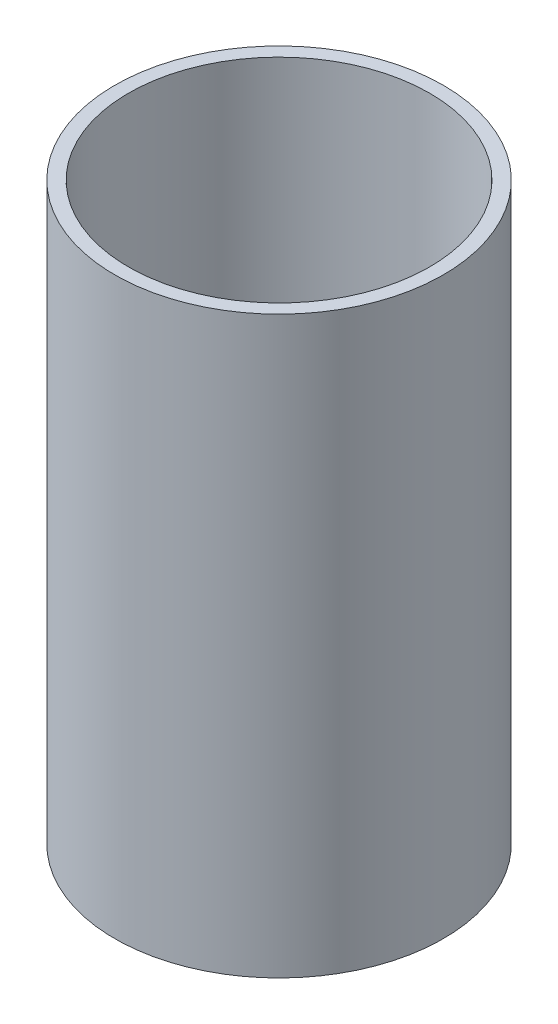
from build123d import *

# Parameters (mm, degrees)
SKETCH1_R           = 12
SKETCH1_R_2         = 11
BOSS_EXTRUDE1_DEPTH = 21


with BuildPart() as part:
    # Sketch1 → Boss-Extrude1 (new, symmetric)
    with BuildSketch(Plane(origin=(0, 0, 0), x_dir=(1, 0, 0), z_dir=(0, 1, 0))):
        with Locations(Location((0, 0, 0), (0, 0, 90))):
            Circle(SKETCH1_R)
        with Locations(Location((0, 0, 0), (0, 0, 90))):
            Circle(SKETCH1_R_2, mode=Mode.SUBTRACT)
    extrude(amount=BOSS_EXTRUDE1_DEPTH, both=True)


solid = part.part
